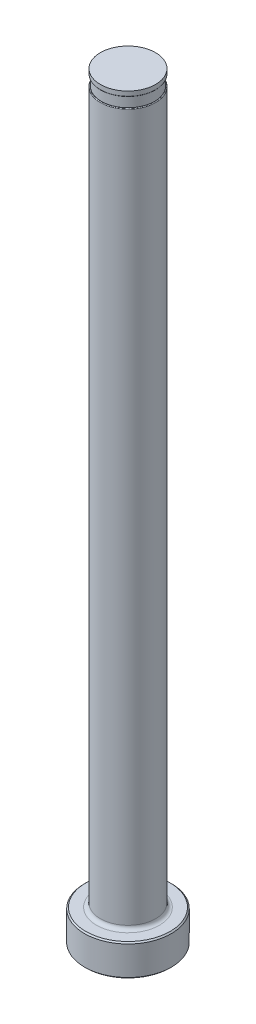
ISO-10303-21;
HEADER;
FILE_DESCRIPTION(('STEP AP214'),'2;1');
FILE_NAME('part.step','',(''),(''),'','','');
FILE_SCHEMA(('AUTOMOTIVE_DESIGN { 1 0 10303 214 1 1 1 1 }'));
ENDSEC;
DATA;
#1=APPLICATION_CONTEXT('core data for automotive mechanical design processes');
#2=APPLICATION_PROTOCOL_DEFINITION('international standard','automotive_design',2000,#1);
#3=PRODUCT_CONTEXT('',#1,'mechanical');
#4=PRODUCT('Part','Part','',(#3));
#5=PRODUCT_RELATED_PRODUCT_CATEGORY('part','',(#4));
#6=PRODUCT_DEFINITION_FORMATION('','',#4);
#7=PRODUCT_DEFINITION_CONTEXT('part definition',#1,'design');
#8=PRODUCT_DEFINITION('design','',#6,#7);
#9=PRODUCT_DEFINITION_SHAPE('','',#8);
#10=(LENGTH_UNIT() NAMED_UNIT(*) SI_UNIT(.MILLI.,.METRE.));
#11=(NAMED_UNIT(*) PLANE_ANGLE_UNIT() SI_UNIT($,.RADIAN.));
#12=(NAMED_UNIT(*) SI_UNIT($,.STERADIAN.) SOLID_ANGLE_UNIT());
#13=UNCERTAINTY_MEASURE_WITH_UNIT(LENGTH_MEASURE(1.E-05),#10,'distance_accuracy_value','');
#14=(GEOMETRIC_REPRESENTATION_CONTEXT(3) GLOBAL_UNCERTAINTY_ASSIGNED_CONTEXT((#13)) GLOBAL_UNIT_ASSIGNED_CONTEXT((#10,
#11,#12)) REPRESENTATION_CONTEXT('',''));
#15=CARTESIAN_POINT('',(0.,0.,0.));
#16=DIRECTION('',(0.,0.,1.));
#17=DIRECTION('',(1.,0.,0.));
#18=AXIS2_PLACEMENT_3D('',#15,#16,#17);
#19=CARTESIAN_POINT('',(-5.55624999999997,151.384,0.));
#20=DIRECTION('',(0.,1.,0.));
#21=DIRECTION('',(0.,0.,1.));
#22=AXIS2_PLACEMENT_3D('',#19,#20,#21);
#23=PLANE('',#22);
#24=CARTESIAN_POINT('',(0.,151.384,0.));
#25=DIRECTION('',(0.,1.,0.));
#26=DIRECTION('',(0.,0.,1.));
#27=AXIS2_PLACEMENT_3D('',#24,#25,#26);
#28=CIRCLE('',#27,5.42416999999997);
#29=CARTESIAN_POINT('',(0.,151.384,5.42416999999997));
#30=VERTEX_POINT('',#29);
#31=EDGE_CURVE('E11',#30,#30,#28,.F.);
#32=ORIENTED_EDGE('',*,*,#31,.T.);
#33=EDGE_LOOP('',(#32));
#34=FACE_BOUND('',#33,.T.);
#35=CARTESIAN_POINT('',(0.,151.384,0.));
#36=DIRECTION('',(0.,1.,0.));
#37=DIRECTION('',(0.,0.,1.));
#38=AXIS2_PLACEMENT_3D('',#35,#36,#37);
#39=CIRCLE('',#38,5.35304999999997);
#40=CARTESIAN_POINT('',(0.,151.384,5.35304999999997));
#41=VERTEX_POINT('',#40);
#42=EDGE_CURVE('E78',#41,#41,#39,.T.);
#43=ORIENTED_EDGE('',*,*,#42,.T.);
#44=EDGE_LOOP('',(#43));
#45=FACE_BOUND('',#44,.T.);
#46=ADVANCED_FACE('F36',(#34,#45),#23,.F.);
#47=CARTESIAN_POINT('',(0.,259.958771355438,0.));
#48=DIRECTION('',(0.,1.,0.));
#49=DIRECTION('',(0.,0.,1.));
#50=AXIS2_PLACEMENT_3D('',#47,#48,#49);
#51=CYLINDRICAL_SURFACE('',#50,5.55624999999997);
#52=DIRECTION('',(0.,1.,0.));
#53=VECTOR('',#52,1.);
#54=CARTESIAN_POINT('',(-5.35304999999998,259.958771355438,-1.48888205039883));
#55=LINE('',#54,#53);
#56=CARTESIAN_POINT('',(-5.35304999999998,149.225,-1.48888205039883));
#57=VERTEX_POINT('',#56);
#58=CARTESIAN_POINT('',(-5.35304999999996,86.868,-1.48888205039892));
#59=VERTEX_POINT('',#58);
#60=EDGE_CURVE('E73',#57,#59,#55,.F.);
#61=ORIENTED_EDGE('',*,*,#60,.F.);
#62=CARTESIAN_POINT('',(0.,149.225,0.));
#63=DIRECTION('',(0.,-1.,0.));
#64=DIRECTION('',(0.,0.,-1.));
#65=AXIS2_PLACEMENT_3D('',#62,#63,#64);
#66=CIRCLE('',#65,5.55624999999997);
#67=CARTESIAN_POINT('',(-5.35304999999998,149.225,1.48888205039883));
#68=VERTEX_POINT('',#67);
#69=EDGE_CURVE('E51',#57,#68,#66,.T.);
#70=ORIENTED_EDGE('',*,*,#69,.T.);
#71=DIRECTION('',(0.,1.,0.));
#72=VECTOR('',#71,1.);
#73=CARTESIAN_POINT('',(-5.35304999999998,259.958771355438,1.48888205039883));
#74=LINE('',#73,#72);
#75=CARTESIAN_POINT('',(-5.35304999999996,86.868,1.48888205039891));
#76=VERTEX_POINT('',#75);
#77=EDGE_CURVE('E84',#76,#68,#74,.T.);
#78=ORIENTED_EDGE('',*,*,#77,.F.);
#79=CARTESIAN_POINT('',(-5.35304999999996,86.868,-1.48888205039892));
#80=CARTESIAN_POINT('',(-5.35304712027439,86.8399400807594,-1.48888592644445));
#81=CARTESIAN_POINT('',(-5.35342246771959,86.811898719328,-1.48754344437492));
#82=CARTESIAN_POINT('',(-5.35490012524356,86.7561072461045,-1.48221807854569));
#83=CARTESIAN_POINT('',(-5.3560019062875,86.7283569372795,-1.47823711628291));
#84=CARTESIAN_POINT('',(-5.36032637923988,86.6463774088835,-1.46251079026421));
#85=CARTESIAN_POINT('',(-5.36456936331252,86.5928852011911,-1.44697968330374));
#86=CARTESIAN_POINT('',(-5.37522073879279,86.4898696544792,-1.40688871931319));
#87=CARTESIAN_POINT('',(-5.38162399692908,86.4403372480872,-1.38235025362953));
#88=CARTESIAN_POINT('',(-5.39588416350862,86.3460393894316,-1.3255962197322));
#89=CARTESIAN_POINT('',(-5.40374399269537,86.3012838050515,-1.29336518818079));
#90=CARTESIAN_POINT('',(-5.42234104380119,86.2060810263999,-1.21335067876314));
#91=CARTESIAN_POINT('',(-5.43329059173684,86.1572435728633,-1.16370716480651));
#92=CARTESIAN_POINT('',(-5.45504519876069,86.0683973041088,-1.05705847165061));
#93=CARTESIAN_POINT('',(-5.46585002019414,86.0284016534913,-1.0000425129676));
#94=CARTESIAN_POINT('',(-5.48941062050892,85.9462379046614,-0.862814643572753));
#95=CARTESIAN_POINT('',(-5.50177933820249,85.9070172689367,-0.780775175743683));
#96=CARTESIAN_POINT('',(-5.52319531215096,85.8420184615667,-0.61119833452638));
#97=CARTESIAN_POINT('',(-5.53224012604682,85.8162501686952,-0.523656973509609));
#98=CARTESIAN_POINT('',(-5.54633656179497,85.7769210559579,-0.343981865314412));
#99=CARTESIAN_POINT('',(-5.551315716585,85.7635811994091,-0.251794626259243));
#100=CARTESIAN_POINT('',(-5.55663041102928,85.7493656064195,-0.0663077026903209));
#101=CARTESIAN_POINT('',(-5.5569631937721,85.7484972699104,0.0269926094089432));
#102=CARTESIAN_POINT('',(-5.55261816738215,85.7600778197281,0.228128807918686));
#103=CARTESIAN_POINT('',(-5.5471061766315,85.7747433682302,0.335828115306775));
#104=CARTESIAN_POINT('',(-5.53028051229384,85.8217503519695,0.546872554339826));
#105=CARTESIAN_POINT('',(-5.51897217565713,85.85407552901,0.650221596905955));
#106=CARTESIAN_POINT('',(-5.49592210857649,85.9257771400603,0.81966257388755));
#107=CARTESIAN_POINT('',(-5.48524552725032,85.9604328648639,0.88790475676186));
#108=CARTESIAN_POINT('',(-5.46261932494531,86.0400662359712,1.01785270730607));
#109=CARTESIAN_POINT('',(-5.45067176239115,86.0850273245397,1.07956873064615));
#110=CARTESIAN_POINT('',(-5.42934912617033,86.1749408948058,1.18161350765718));
#111=CARTESIAN_POINT('',(-5.41996423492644,86.2178853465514,1.22370530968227));
#112=CARTESIAN_POINT('',(-5.40207756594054,86.3102163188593,1.30039205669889));
#113=CARTESIAN_POINT('',(-5.3935749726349,86.3595967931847,1.33499395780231));
#114=CARTESIAN_POINT('',(-5.37957377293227,86.4560291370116,1.39024779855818));
#115=CARTESIAN_POINT('',(-5.37381465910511,86.5022834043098,1.41222354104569));
#116=CARTESIAN_POINT('',(-5.36419527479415,86.5979194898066,1.44833565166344));
#117=CARTESIAN_POINT('',(-5.36033174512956,86.6472957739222,1.46248548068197));
#118=CARTESIAN_POINT('',(-5.3561211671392,86.7255749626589,1.47780624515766));
#119=CARTESIAN_POINT('',(-5.35497463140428,86.75388137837,1.48194947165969));
#120=CARTESIAN_POINT('',(-5.35343719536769,86.8107860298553,1.48749027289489));
#121=CARTESIAN_POINT('',(-5.35304641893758,86.8393843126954,1.4888873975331));
#122=CARTESIAN_POINT('',(-5.35304999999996,86.868,1.48888205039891));
#123=B_SPLINE_CURVE_WITH_KNOTS('',3,(#79,#80,#81,#82,#83,#84,#85,#86,#87,#88,#89,#90,#91,#92,
#93,#94,#95,#96,#97,#98,#99,#100,#101,#102,#103,#104,#105,#106,#107,#108,#109,#110,#111,#112,
#113,#114,#115,#116,#117,#118,#119,#120,#121,#122),.UNSPECIFIED.,.F.,.F.,(4,2,2,2,2,2,2,2,2,2,2,
2,2,2,2,2,2,2,2,2,2,4),(0.,0.0841097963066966,0.168158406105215,0.334679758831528,
0.50080817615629,0.667273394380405,0.87762078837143,1.0882792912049,1.36213137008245,
1.63618427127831,1.91502141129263,2.19402399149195,2.51897339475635,2.84362413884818,
3.07466463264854,3.30533648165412,3.48723774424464,3.66896933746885,3.82292542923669,
3.97661588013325,4.06237930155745,4.14815677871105),.UNSPECIFIED.);
#124=EDGE_CURVE('E81',#59,#76,#123,.T.);
#125=ORIENTED_EDGE('',*,*,#124,.F.);
#126=EDGE_LOOP('',(#61,#70,#78,#125));
#127=FACE_BOUND('',#126,.T.);
#128=CARTESIAN_POINT('',(0.,7.11200000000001,0.));
#129=DIRECTION('',(0.,1.,0.));
#130=DIRECTION('',(0.,0.,1.));
#131=AXIS2_PLACEMENT_3D('',#128,#129,#130);
#132=CIRCLE('',#131,5.55624999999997);
#133=CARTESIAN_POINT('',(0.,7.11200000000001,5.55624999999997));
#134=VERTEX_POINT('',#133);
#135=EDGE_CURVE('E116',#134,#134,#132,.T.);
#136=ORIENTED_EDGE('',*,*,#135,.T.);
#137=EDGE_LOOP('',(#136));
#138=FACE_BOUND('',#137,.T.);
#139=ADVANCED_FACE('F82',(#127,#138),#51,.T.);
#140=CARTESIAN_POINT('',(0.,0.,0.));
#141=DIRECTION('',(0.,-1.,0.));
#142=DIRECTION('',(0.,0.,-1.));
#143=AXIS2_PLACEMENT_3D('',#140,#141,#142);
#144=PLANE('',#143);
#145=CARTESIAN_POINT('',(0.,0.,0.));
#146=DIRECTION('',(0.,-1.,0.));
#147=DIRECTION('',(0.,0.,-1.));
#148=AXIS2_PLACEMENT_3D('',#145,#146,#147);
#149=CIRCLE('',#148,8.47089999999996);
#150=CARTESIAN_POINT('',(0.,0.,-8.47089999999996));
#151=VERTEX_POINT('',#150);
#152=EDGE_CURVE('E113',#151,#151,#149,.T.);
#153=ORIENTED_EDGE('',*,*,#152,.T.);
#154=EDGE_LOOP('',(#153));
#155=FACE_BOUND('',#154,.T.);
#156=ADVANCED_FACE('F192',(#155),#144,.T.);
#157=CARTESIAN_POINT('',(0.,259.958771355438,0.));
#158=DIRECTION('',(0.,1.,0.));
#159=DIRECTION('',(0.,0.,1.));
#160=AXIS2_PLACEMENT_3D('',#157,#158,#159);
#161=CYLINDRICAL_SURFACE('',#160,8.72489999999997);
#162=CARTESIAN_POINT('',(0.,6.09600000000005,0.));
#163=DIRECTION('',(0.,1.,0.));
#164=DIRECTION('',(0.,0.,1.));
#165=AXIS2_PLACEMENT_3D('',#162,#163,#164);
#166=CIRCLE('',#165,8.72489999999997);
#167=CARTESIAN_POINT('',(0.,6.09600000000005,8.72489999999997));
#168=VERTEX_POINT('',#167);
#169=EDGE_CURVE('E110',#168,#168,#166,.F.);
#170=ORIENTED_EDGE('',*,*,#169,.T.);
#171=EDGE_LOOP('',(#170));
#172=FACE_BOUND('',#171,.T.);
#173=CARTESIAN_POINT('',(0.,0.254000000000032,0.));
#174=DIRECTION('',(0.,-1.,0.));
#175=DIRECTION('',(0.,0.,-1.));
#176=AXIS2_PLACEMENT_3D('',#173,#174,#175);
#177=CIRCLE('',#176,8.72489999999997);
#178=CARTESIAN_POINT('',(0.,0.254000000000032,-8.72489999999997));
#179=VERTEX_POINT('',#178);
#180=EDGE_CURVE('E107',#179,#179,#177,.F.);
#181=ORIENTED_EDGE('',*,*,#180,.T.);
#182=EDGE_LOOP('',(#181));
#183=FACE_BOUND('',#182,.T.);
#184=ADVANCED_FACE('F195',(#172,#183),#161,.T.);
#185=CARTESIAN_POINT('',(-8.72489999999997,6.35,0.));
#186=DIRECTION('',(0.,1.,0.));
#187=DIRECTION('',(0.,0.,1.));
#188=AXIS2_PLACEMENT_3D('',#185,#186,#187);
#189=PLANE('',#188);
#190=CARTESIAN_POINT('',(0.,6.35,0.));
#191=DIRECTION('',(0.,1.,0.));
#192=DIRECTION('',(0.,0.,1.));
#193=AXIS2_PLACEMENT_3D('',#190,#191,#192);
#194=CIRCLE('',#193,6.31824999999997);
#195=CARTESIAN_POINT('',(0.,6.35,6.31824999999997));
#196=VERTEX_POINT('',#195);
#197=EDGE_CURVE('E87',#196,#196,#194,.F.);
#198=ORIENTED_EDGE('',*,*,#197,.T.);
#199=EDGE_LOOP('',(#198));
#200=FACE_BOUND('',#199,.T.);
#201=CARTESIAN_POINT('',(0.,6.35,0.));
#202=DIRECTION('',(0.,1.,0.));
#203=DIRECTION('',(0.,0.,1.));
#204=AXIS2_PLACEMENT_3D('',#201,#202,#203);
#205=CIRCLE('',#204,8.47090000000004);
#206=CARTESIAN_POINT('',(0.,6.35,8.47090000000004));
#207=VERTEX_POINT('',#206);
#208=EDGE_CURVE('E104',#207,#207,#205,.T.);
#209=ORIENTED_EDGE('',*,*,#208,.T.);
#210=EDGE_LOOP('',(#209));
#211=FACE_BOUND('',#210,.T.);
#212=ADVANCED_FACE('F190',(#200,#211),#189,.T.);
#213=CARTESIAN_POINT('',(0.,6.35000000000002,0.));
#214=DIRECTION('',(0.,-1.,0.));
#215=DIRECTION('',(0.,0.,-1.));
#216=AXIS2_PLACEMENT_3D('',#213,#214,#215);
#217=CONICAL_SURFACE('',#216,8.47090000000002,0.785398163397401);
#218=ORIENTED_EDGE('',*,*,#169,.F.);
#219=EDGE_LOOP('',(#218));
#220=FACE_BOUND('',#219,.T.);
#221=ORIENTED_EDGE('',*,*,#208,.F.);
#222=EDGE_LOOP('',(#221));
#223=FACE_BOUND('',#222,.T.);
#224=ADVANCED_FACE('F186',(#220,#223),#217,.T.);
#225=CARTESIAN_POINT('',(0.,0.254000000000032,0.));
#226=DIRECTION('',(0.,1.,0.));
#227=DIRECTION('',(0.,0.,1.));
#228=AXIS2_PLACEMENT_3D('',#225,#226,#227);
#229=CONICAL_SURFACE('',#228,8.72489999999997,0.785398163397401);
#230=ORIENTED_EDGE('',*,*,#152,.F.);
#231=EDGE_LOOP('',(#230));
#232=FACE_BOUND('',#231,.T.);
#233=ORIENTED_EDGE('',*,*,#180,.F.);
#234=EDGE_LOOP('',(#233));
#235=FACE_BOUND('',#234,.T.);
#236=ADVANCED_FACE('F182',(#232,#235),#229,.T.);
#237=CARTESIAN_POINT('',(0.,7.11200000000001,0.));
#238=DIRECTION('',(0.,1.,0.));
#239=DIRECTION('',(0.,0.,1.));
#240=AXIS2_PLACEMENT_3D('',#237,#238,#239);
#241=TOROIDAL_SURFACE('',#240,6.31824999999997,0.762);
#242=ORIENTED_EDGE('',*,*,#197,.F.);
#243=EDGE_LOOP('',(#242));
#244=FACE_BOUND('',#243,.T.);
#245=ORIENTED_EDGE('',*,*,#135,.F.);
#246=EDGE_LOOP('',(#245));
#247=FACE_BOUND('',#246,.T.);
#248=ADVANCED_FACE('F147',(#244,#247),#241,.F.);
#249=CARTESIAN_POINT('',(-5.55624999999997,149.352,0.));
#250=DIRECTION('',(0.,-1.,0.));
#251=DIRECTION('',(0.,0.,-1.));
#252=AXIS2_PLACEMENT_3D('',#249,#250,#251);
#253=PLANE('',#252);
#254=DIRECTION('',(0.,0.,1.));
#255=VECTOR('',#254,1.);
#256=CARTESIAN_POINT('',(-5.35304999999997,149.352,0.));
#257=LINE('',#256,#255);
#258=CARTESIAN_POINT('',(-5.35304999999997,149.352,0.));
#259=VERTEX_POINT('',#258);
#260=CARTESIAN_POINT('',(-5.35304999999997,149.352,0.906427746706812));
#261=VERTEX_POINT('',#260);
#262=EDGE_CURVE('E90',#259,#261,#257,.T.);
#263=ORIENTED_EDGE('',*,*,#262,.T.);
#264=CARTESIAN_POINT('',(0.,149.352,0.));
#265=DIRECTION('',(0.,-1.,0.));
#266=DIRECTION('',(0.,0.,-1.));
#267=AXIS2_PLACEMENT_3D('',#264,#265,#266);
#268=CIRCLE('',#267,5.42924999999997);
#269=CARTESIAN_POINT('',(-5.35304999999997,149.352,-0.906427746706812));
#270=VERTEX_POINT('',#269);
#271=EDGE_CURVE('E86',#261,#270,#268,.F.);
#272=ORIENTED_EDGE('',*,*,#271,.T.);
#273=EDGE_CURVE('E79',#270,#259,#257,.T.);
#274=ORIENTED_EDGE('',*,*,#273,.T.);
#275=CARTESIAN_POINT('',(0.,149.352,0.));
#276=DIRECTION('',(0.,1.,0.));
#277=DIRECTION('',(0.,0.,1.));
#278=AXIS2_PLACEMENT_3D('',#275,#276,#277);
#279=CIRCLE('',#278,5.35304999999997);
#280=EDGE_CURVE('E101',#259,#259,#279,.T.);
#281=ORIENTED_EDGE('',*,*,#280,.F.);
#282=EDGE_LOOP('',(#263,#272,#274,#281));
#283=FACE_BOUND('',#282,.T.);
#284=ADVANCED_FACE('F144',(#283),#253,.F.);
#285=CARTESIAN_POINT('',(0.,153.448281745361,0.));
#286=DIRECTION('',(0.,1.,0.));
#287=DIRECTION('',(0.,0.,1.));
#288=AXIS2_PLACEMENT_3D('',#285,#286,#287);
#289=CYLINDRICAL_SURFACE('',#288,5.35304999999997);
#290=ORIENTED_EDGE('',*,*,#42,.F.);
#291=EDGE_LOOP('',(#290));
#292=FACE_BOUND('',#291,.T.);
#293=ORIENTED_EDGE('',*,*,#280,.T.);
#294=EDGE_LOOP('',(#293));
#295=FACE_BOUND('',#294,.T.);
#296=ADVANCED_FACE('F141',(#292,#295),#289,.T.);
#297=CARTESIAN_POINT('',(-5.35304999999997,150.368,-8.72489999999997));
#298=DIRECTION('',(1.,0.,0.));
#299=DIRECTION('',(0.,1.,0.));
#300=AXIS2_PLACEMENT_3D('',#297,#298,#299);
#301=PLANE('',#300);
#302=ORIENTED_EDGE('',*,*,#273,.F.);
#303=CARTESIAN_POINT('',(-5.35304999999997,149.352,-0.906427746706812));
#304=CARTESIAN_POINT('',(-5.35304999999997,149.351997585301,-0.927323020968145));
#305=CARTESIAN_POINT('',(-5.35304999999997,149.351856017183,-0.948219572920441));
#306=CARTESIAN_POINT('',(-5.35304999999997,149.351220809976,-0.990022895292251));
#307=CARTESIAN_POINT('',(-5.35304999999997,149.35072690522,-1.01092966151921));
#308=CARTESIAN_POINT('',(-5.35304999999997,149.349293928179,-1.05329459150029));
#309=CARTESIAN_POINT('',(-5.35304999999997,149.348343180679,-1.07475238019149));
#310=CARTESIAN_POINT('',(-5.35304999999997,149.345886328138,-1.11762595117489));
#311=CARTESIAN_POINT('',(-5.35304999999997,149.344380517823,-1.13904174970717));
#312=CARTESIAN_POINT('',(-5.35304999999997,149.340668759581,-1.18182014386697));
#313=CARTESIAN_POINT('',(-5.35304999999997,149.338462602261,-1.20318272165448));
#314=CARTESIAN_POINT('',(-5.35304999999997,149.333137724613,-1.24583267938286));
#315=CARTESIAN_POINT('',(-5.35304999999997,149.330017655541,-1.26711990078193));
#316=CARTESIAN_POINT('',(-5.35304999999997,149.322562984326,-1.30920547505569));
#317=CARTESIAN_POINT('',(-5.35304999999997,149.318244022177,-1.33000661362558));
#318=CARTESIAN_POINT('',(-5.35304999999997,149.307803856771,-1.37114198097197));
#319=CARTESIAN_POINT('',(-5.35304999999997,149.301688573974,-1.39147751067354));
#320=CARTESIAN_POINT('',(-5.35304999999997,149.291778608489,-1.41655009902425));
#321=CARTESIAN_POINT('',(-5.35304999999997,149.289524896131,-1.4218879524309));
#322=CARTESIAN_POINT('',(-5.35304999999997,149.284682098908,-1.43243190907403));
#323=CARTESIAN_POINT('',(-5.35304999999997,149.282092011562,-1.43763756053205));
#324=CARTESIAN_POINT('',(-5.35304999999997,149.276182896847,-1.44837668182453));
#325=CARTESIAN_POINT('',(-5.35304999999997,149.272815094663,-1.45388357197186));
#326=CARTESIAN_POINT('',(-5.35304999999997,149.265355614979,-1.46438624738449));
#327=CARTESIAN_POINT('',(-5.35304999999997,149.261267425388,-1.46938432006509));
#328=CARTESIAN_POINT('',(-5.35304999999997,149.254750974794,-1.47569818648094));
#329=CARTESIAN_POINT('',(-5.35304999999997,149.252754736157,-1.4774548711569));
#330=CARTESIAN_POINT('',(-5.35304999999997,149.248555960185,-1.48070710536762));
#331=CARTESIAN_POINT('',(-5.35304999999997,149.246353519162,-1.48220277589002));
#332=CARTESIAN_POINT('',(-5.35304999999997,149.242086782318,-1.48462572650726));
#333=CARTESIAN_POINT('',(-5.35304999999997,149.240052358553,-1.48560484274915));
#334=CARTESIAN_POINT('',(-5.35304999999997,149.235851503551,-1.48721324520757));
#335=CARTESIAN_POINT('',(-5.35304999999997,149.233685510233,-1.48784362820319));
#336=CARTESIAN_POINT('',(-5.35304999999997,149.230414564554,-1.48846795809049));
#337=CARTESIAN_POINT('',(-5.35304999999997,149.229338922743,-1.48862246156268));
#338=CARTESIAN_POINT('',(-5.35304999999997,149.227175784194,-1.48882979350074));
#339=CARTESIAN_POINT('',(-5.35304999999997,149.226088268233,-1.48888242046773));
#340=CARTESIAN_POINT('',(-5.35304999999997,149.225,-1.48888205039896));
#341=B_SPLINE_CURVE_WITH_KNOTS('',3,(#303,#304,#305,#306,#307,#308,#309,#310,#311,#312,#313,
#314,#315,#316,#317,#318,#319,#320,#321,#322,#323,#324,#325,#326,#327,#328,#329,#330,#331,#332,
#333,#334,#335,#336,#337,#338,#339,#340),.UNSPECIFIED.,.F.,.F.,(4,2,2,2,2,2,2,2,2,2,2,2,2,2,2,2,
2,2,4),(0.,0.0626873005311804,0.125421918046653,0.189852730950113,0.254249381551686,
0.318665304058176,0.383176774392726,0.446883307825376,0.510382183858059,0.527756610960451,
0.54518406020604,0.564521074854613,0.583766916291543,0.591729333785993,0.599688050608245,
0.606437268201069,0.613165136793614,0.616420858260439,0.619683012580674),.UNSPECIFIED.);
#342=EDGE_CURVE('E59',#270,#57,#341,.T.);
#343=ORIENTED_EDGE('',*,*,#342,.T.);
#344=ORIENTED_EDGE('',*,*,#60,.T.);
#345=DIRECTION('',(0.,0.,1.));
#346=VECTOR('',#345,1.);
#347=CARTESIAN_POINT('',(-5.35304999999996,86.868,-8.72489999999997));
#348=LINE('',#347,#346);
#349=EDGE_CURVE('E77',#59,#76,#348,.T.);
#350=ORIENTED_EDGE('',*,*,#349,.T.);
#351=ORIENTED_EDGE('',*,*,#77,.T.);
#352=CARTESIAN_POINT('',(-5.35304999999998,149.225,1.48888205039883));
#353=CARTESIAN_POINT('',(-5.35304999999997,149.227315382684,1.48889020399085));
#354=CARTESIAN_POINT('',(-5.35304999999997,149.229618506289,1.48864616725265));
#355=CARTESIAN_POINT('',(-5.35304999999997,149.234103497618,1.48773344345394));
#356=CARTESIAN_POINT('',(-5.35304999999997,149.236286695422,1.48707143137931));
#357=CARTESIAN_POINT('',(-5.35304999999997,149.241009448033,1.48520073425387));
#358=CARTESIAN_POINT('',(-5.35304999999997,149.243511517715,1.4838999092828));
#359=CARTESIAN_POINT('',(-5.35304999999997,149.24828827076,1.48091465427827));
#360=CARTESIAN_POINT('',(-5.35304999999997,149.250561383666,1.47922780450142));
#361=CARTESIAN_POINT('',(-5.35304999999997,149.256524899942,1.47421628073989));
#362=CARTESIAN_POINT('',(-5.35304999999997,149.259983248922,1.47061948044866));
#363=CARTESIAN_POINT('',(-5.35304999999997,149.266372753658,1.4629969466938));
#364=CARTESIAN_POINT('',(-5.35304999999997,149.269302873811,1.45897039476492));
#365=CARTESIAN_POINT('',(-5.35304999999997,149.27618028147,1.44851786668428));
#366=CARTESIAN_POINT('',(-5.35304999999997,149.27987230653,1.44192584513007));
#367=CARTESIAN_POINT('',(-5.35304999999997,149.286640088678,1.42842790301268));
#368=CARTESIAN_POINT('',(-5.35304999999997,149.289714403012,1.42152129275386));
#369=CARTESIAN_POINT('',(-5.35304999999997,149.298282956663,1.40046246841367));
#370=CARTESIAN_POINT('',(-5.35304999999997,149.303087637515,1.38603333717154));
#371=CARTESIAN_POINT('',(-5.35304999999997,149.315626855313,1.34303383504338));
#372=CARTESIAN_POINT('',(-5.35304999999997,149.321813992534,1.31403988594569));
#373=CARTESIAN_POINT('',(-5.35304999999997,149.331934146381,1.25562656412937));
#374=CARTESIAN_POINT('',(-5.35304999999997,149.33586080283,1.22620622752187));
#375=CARTESIAN_POINT('',(-5.35304999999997,149.342178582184,1.16719231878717));
#376=CARTESIAN_POINT('',(-5.35304999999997,149.344569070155,1.13759868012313));
#377=CARTESIAN_POINT('',(-5.35304999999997,149.348250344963,1.07838180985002));
#378=CARTESIAN_POINT('',(-5.35304999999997,149.349542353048,1.04875864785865));
#379=CARTESIAN_POINT('',(-5.35304999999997,149.350983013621,1.00031217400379));
#380=CARTESIAN_POINT('',(-5.35304999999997,149.35137689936,0.98149542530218));
#381=CARTESIAN_POINT('',(-5.35304999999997,149.351884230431,0.943928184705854));
#382=CARTESIAN_POINT('',(-5.35304999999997,149.351998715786,0.925177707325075));
#383=CARTESIAN_POINT('',(-5.35304999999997,149.352,0.906427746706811));
#384=B_SPLINE_CURVE_WITH_KNOTS('',3,(#352,#353,#354,#355,#356,#357,#358,#359,#360,#361,#362,
#363,#364,#365,#366,#367,#368,#369,#370,#371,#372,#373,#374,#375,#376,#377,#378,#379,#380,#381,
#382,#383),.UNSPECIFIED.,.F.,.F.,(4,2,2,2,2,2,2,2,2,2,2,2,2,2,2,4),(0.,0.00691371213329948,
0.0137197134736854,0.0221318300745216,0.0305981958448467,0.0454833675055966,0.0603974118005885,
0.0830067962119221,0.105668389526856,0.151203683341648,0.23995736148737,0.328959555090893,
0.41799851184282,0.506938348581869,0.563399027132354,0.619649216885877),.UNSPECIFIED.);
#385=EDGE_CURVE('E172',#68,#261,#384,.T.);
#386=ORIENTED_EDGE('',*,*,#385,.T.);
#387=ORIENTED_EDGE('',*,*,#262,.F.);
#388=EDGE_LOOP('',(#302,#343,#344,#350,#351,#386,#387));
#389=FACE_BOUND('',#388,.T.);
#390=ADVANCED_FACE('F75',(#389),#301,.F.);
#391=CARTESIAN_POINT('',(-8.52804999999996,86.868,-8.72489999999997));
#392=DIRECTION('',(0.,0.,1.));
#393=DIRECTION('',(1.,0.,0.));
#394=AXIS2_PLACEMENT_3D('',#391,#392,#393);
#395=CYLINDRICAL_SURFACE('',#394,3.175);
#396=ORIENTED_EDGE('',*,*,#349,.F.);
#397=ORIENTED_EDGE('',*,*,#124,.T.);
#398=EDGE_LOOP('',(#396,#397));
#399=FACE_BOUND('',#398,.T.);
#400=ADVANCED_FACE('F89',(#399),#395,.F.);
#401=CARTESIAN_POINT('',(0.,152.687735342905,0.));
#402=DIRECTION('',(0.,1.,0.));
#403=DIRECTION('',(0.,0.,1.));
#404=AXIS2_PLACEMENT_3D('',#401,#402,#403);
#405=CYLINDRICAL_SURFACE('',#404,5.55116999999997);
#406=CARTESIAN_POINT('',(0.,151.511,0.));
#407=DIRECTION('',(0.,1.,0.));
#408=DIRECTION('',(0.,0.,1.));
#409=AXIS2_PLACEMENT_3D('',#406,#407,#408);
#410=CIRCLE('',#409,5.55116999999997);
#411=CARTESIAN_POINT('',(0.,151.511,5.55116999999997));
#412=VERTEX_POINT('',#411);
#413=EDGE_CURVE('E44',#412,#412,#410,.T.);
#414=ORIENTED_EDGE('',*,*,#413,.T.);
#415=EDGE_LOOP('',(#414));
#416=FACE_BOUND('',#415,.T.);
#417=CARTESIAN_POINT('',(0.,152.4,0.));
#418=DIRECTION('',(0.,1.,0.));
#419=DIRECTION('',(0.,0.,1.));
#420=AXIS2_PLACEMENT_3D('',#417,#418,#419);
#421=CIRCLE('',#420,5.55116999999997);
#422=CARTESIAN_POINT('',(0.,152.4,5.55116999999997));
#423=VERTEX_POINT('',#422);
#424=EDGE_CURVE('E91',#423,#423,#421,.T.);
#425=ORIENTED_EDGE('',*,*,#424,.F.);
#426=EDGE_LOOP('',(#425));
#427=FACE_BOUND('',#426,.T.);
#428=ADVANCED_FACE('F135',(#416,#427),#405,.T.);
#429=CARTESIAN_POINT('',(-5.55624999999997,152.4,0.));
#430=DIRECTION('',(0.,1.,0.));
#431=DIRECTION('',(0.,0.,1.));
#432=AXIS2_PLACEMENT_3D('',#429,#430,#431);
#433=PLANE('',#432);
#434=ORIENTED_EDGE('',*,*,#424,.T.);
#435=EDGE_LOOP('',(#434));
#436=FACE_BOUND('',#435,.T.);
#437=ADVANCED_FACE('F149',(#436),#433,.T.);
#438=CARTESIAN_POINT('',(0.,149.225,0.));
#439=DIRECTION('',(0.,-1.,0.));
#440=DIRECTION('',(0.,0.,-1.));
#441=AXIS2_PLACEMENT_3D('',#438,#439,#440);
#442=TOROIDAL_SURFACE('',#441,5.42924999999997,0.127);
#443=ORIENTED_EDGE('',*,*,#385,.F.);
#444=ORIENTED_EDGE('',*,*,#69,.F.);
#445=ORIENTED_EDGE('',*,*,#342,.F.);
#446=ORIENTED_EDGE('',*,*,#271,.F.);
#447=EDGE_LOOP('',(#443,#444,#445,#446));
#448=FACE_BOUND('',#447,.T.);
#449=ADVANCED_FACE('F151',(#448),#442,.T.);
#450=CARTESIAN_POINT('',(0.,151.511,0.));
#451=DIRECTION('',(0.,1.,0.));
#452=DIRECTION('',(0.,0.,1.));
#453=AXIS2_PLACEMENT_3D('',#450,#451,#452);
#454=TOROIDAL_SURFACE('',#453,5.42416999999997,0.127);
#455=ORIENTED_EDGE('',*,*,#31,.F.);
#456=EDGE_LOOP('',(#455));
#457=FACE_BOUND('',#456,.T.);
#458=ORIENTED_EDGE('',*,*,#413,.F.);
#459=EDGE_LOOP('',(#458));
#460=FACE_BOUND('',#459,.T.);
#461=ADVANCED_FACE('F38',(#457,#460),#454,.T.);
#462=CLOSED_SHELL('',(#46,#139,#156,#184,#212,#224,#236,#248,#284,#296,#390,#400,#428,#437,#449,#461));
#463=MANIFOLD_SOLID_BREP('B2',#462);
#464=ADVANCED_BREP_SHAPE_REPRESENTATION('',(#18,#463),#14);
#465=SHAPE_DEFINITION_REPRESENTATION(#9,#464);
ENDSEC;
END-ISO-10303-21;
